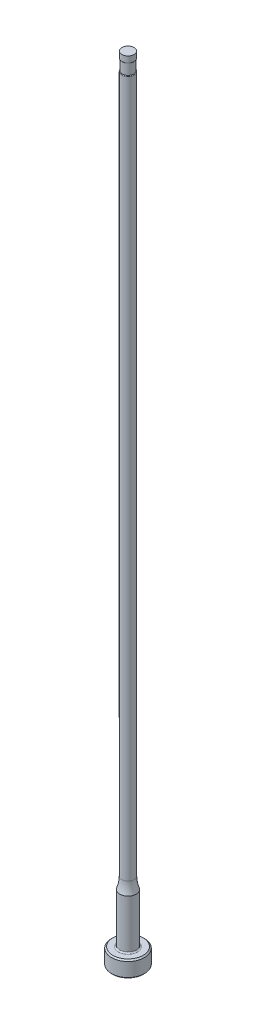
ISO-10303-21;
HEADER;
FILE_DESCRIPTION(('STEP AP214'),'2;1');
FILE_NAME('part.step','',(''),(''),'','','');
FILE_SCHEMA(('AUTOMOTIVE_DESIGN { 1 0 10303 214 1 1 1 1 }'));
ENDSEC;
DATA;
#1=APPLICATION_CONTEXT('core data for automotive mechanical design processes');
#2=APPLICATION_PROTOCOL_DEFINITION('international standard','automotive_design',2000,#1);
#3=PRODUCT_CONTEXT('',#1,'mechanical');
#4=PRODUCT('Part','Part','',(#3));
#5=PRODUCT_RELATED_PRODUCT_CATEGORY('part','',(#4));
#6=PRODUCT_DEFINITION_FORMATION('','',#4);
#7=PRODUCT_DEFINITION_CONTEXT('part definition',#1,'design');
#8=PRODUCT_DEFINITION('design','',#6,#7);
#9=PRODUCT_DEFINITION_SHAPE('','',#8);
#10=(LENGTH_UNIT() NAMED_UNIT(*) SI_UNIT(.MILLI.,.METRE.));
#11=(NAMED_UNIT(*) PLANE_ANGLE_UNIT() SI_UNIT($,.RADIAN.));
#12=(NAMED_UNIT(*) SI_UNIT($,.STERADIAN.) SOLID_ANGLE_UNIT());
#13=UNCERTAINTY_MEASURE_WITH_UNIT(LENGTH_MEASURE(1.E-05),#10,'distance_accuracy_value','');
#14=(GEOMETRIC_REPRESENTATION_CONTEXT(3) GLOBAL_UNCERTAINTY_ASSIGNED_CONTEXT((#13)) GLOBAL_UNIT_ASSIGNED_CONTEXT((#10,
#11,#12)) REPRESENTATION_CONTEXT('',''));
#15=CARTESIAN_POINT('',(0.,0.,0.));
#16=DIRECTION('',(0.,0.,1.));
#17=DIRECTION('',(1.,0.,0.));
#18=AXIS2_PLACEMENT_3D('',#15,#16,#17);
#19=CARTESIAN_POINT('',(0.,259.958771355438,0.));
#20=DIRECTION('',(0.,1.,0.));
#21=DIRECTION('',(0.,0.,1.));
#22=AXIS2_PLACEMENT_3D('',#19,#20,#21);
#23=CYLINDRICAL_SURFACE('',#22,1.18998999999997);
#24=DIRECTION('',(0.,1.,0.));
#25=VECTOR('',#24,1.);
#26=CARTESIAN_POINT('',(-1.08838999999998,259.958771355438,-0.481127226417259));
#27=LINE('',#26,#25);
#28=CARTESIAN_POINT('',(-1.08838999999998,148.973565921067,-0.481127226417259));
#29=VERTEX_POINT('',#28);
#30=CARTESIAN_POINT('',(-1.08838999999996,112.014,-0.481127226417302));
#31=VERTEX_POINT('',#30);
#32=EDGE_CURVE('E66',#29,#31,#27,.F.);
#33=ORIENTED_EDGE('',*,*,#32,.F.);
#34=CARTESIAN_POINT('',(0.,148.973565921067,0.));
#35=DIRECTION('',(0.,1.,0.));
#36=DIRECTION('',(0.,0.,1.));
#37=AXIS2_PLACEMENT_3D('',#34,#35,#36);
#38=CIRCLE('',#37,1.18998999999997);
#39=CARTESIAN_POINT('',(-1.08838999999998,148.973565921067,0.481127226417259));
#40=VERTEX_POINT('',#39);
#41=EDGE_CURVE('E44',#29,#40,#38,.F.);
#42=ORIENTED_EDGE('',*,*,#41,.T.);
#43=DIRECTION('',(0.,1.,0.));
#44=VECTOR('',#43,1.);
#45=CARTESIAN_POINT('',(-1.08838999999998,259.958771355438,0.481127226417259));
#46=LINE('',#45,#44);
#47=CARTESIAN_POINT('',(-1.08838999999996,112.014,0.481127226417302));
#48=VERTEX_POINT('',#47);
#49=EDGE_CURVE('E72',#48,#40,#46,.T.);
#50=ORIENTED_EDGE('',*,*,#49,.F.);
#51=CARTESIAN_POINT('',(-1.08838999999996,112.014,-0.481127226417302));
#52=CARTESIAN_POINT('',(-1.08838966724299,111.985183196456,-0.481120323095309));
#53=CARTESIAN_POINT('',(-1.08878297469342,111.956379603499,-0.480240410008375));
#54=CARTESIAN_POINT('',(-1.0903471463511,111.89887486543,-0.476680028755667));
#55=CARTESIAN_POINT('',(-1.09151883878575,111.870173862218,-0.473997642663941));
#56=CARTESIAN_POINT('',(-1.0962236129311,111.783732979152,-0.463079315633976));
#57=CARTESIAN_POINT('',(-1.10094613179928,111.726365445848,-0.451969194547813));
#58=CARTESIAN_POINT('',(-1.11171709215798,111.627397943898,-0.424640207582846));
#59=CARTESIAN_POINT('',(-1.11720060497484,111.585237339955,-0.41021369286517));
#60=CARTESIAN_POINT('',(-1.12939077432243,111.50375729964,-0.375363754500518));
#61=CARTESIAN_POINT('',(-1.13609165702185,111.46442562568,-0.354968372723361));
#62=CARTESIAN_POINT('',(-1.1472645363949,111.404969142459,-0.316366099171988));
#63=CARTESIAN_POINT('',(-1.15158336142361,111.383348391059,-0.300422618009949));
#64=CARTESIAN_POINT('',(-1.16012072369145,111.342602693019,-0.265553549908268));
#65=CARTESIAN_POINT('',(-1.16433935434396,111.323475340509,-0.246630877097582));
#66=CARTESIAN_POINT('',(-1.17139417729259,111.292625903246,-0.210179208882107));
#67=CARTESIAN_POINT('',(-1.17432972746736,111.280201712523,-0.193268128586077));
#68=CARTESIAN_POINT('',(-1.17964378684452,111.258180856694,-0.157607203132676));
#69=CARTESIAN_POINT('',(-1.18202305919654,111.248580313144,-0.138859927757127));
#70=CARTESIAN_POINT('',(-1.1856222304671,111.234246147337,-0.103155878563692));
#71=CARTESIAN_POINT('',(-1.1869702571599,111.228963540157,-0.0864338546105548));
#72=CARTESIAN_POINT('',(-1.18896221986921,111.221197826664,-0.05230931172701));
#73=CARTESIAN_POINT('',(-1.18960661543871,111.218712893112,-0.0349072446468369));
#74=CARTESIAN_POINT('',(-1.1901191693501,111.216734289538,0.000122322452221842));
#75=CARTESIAN_POINT('',(-1.18998545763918,111.217247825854,0.0177502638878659));
#76=CARTESIAN_POINT('',(-1.18895328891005,111.221240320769,0.0526432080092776));
#77=CARTESIAN_POINT('',(-1.18805460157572,111.224720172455,0.0699080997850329));
#78=CARTESIAN_POINT('',(-1.18562828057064,111.23423683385,0.103108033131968));
#79=CARTESIAN_POINT('',(-1.18411982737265,111.240195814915,0.11906720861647));
#80=CARTESIAN_POINT('',(-1.18061056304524,111.254296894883,0.149921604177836));
#81=CARTESIAN_POINT('',(-1.17860955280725,111.262439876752,0.164816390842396));
#82=CARTESIAN_POINT('',(-1.17313921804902,111.285184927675,0.200749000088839));
#83=CARTESIAN_POINT('',(-1.1694436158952,111.300956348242,0.221012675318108));
#84=CARTESIAN_POINT('',(-1.16168543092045,111.335494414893,0.258718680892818));
#85=CARTESIAN_POINT('',(-1.15762196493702,111.354268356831,0.276153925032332));
#86=CARTESIAN_POINT('',(-1.14734460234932,111.404227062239,0.316729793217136));
#87=CARTESIAN_POINT('',(-1.14110751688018,111.436801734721,0.338145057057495));
#88=CARTESIAN_POINT('',(-1.12927494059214,111.504924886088,0.375765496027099));
#89=CARTESIAN_POINT('',(-1.12368108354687,111.54048055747,0.391957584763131));
#90=CARTESIAN_POINT('',(-1.11078204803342,111.633330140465,0.427525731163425));
#91=CARTESIAN_POINT('',(-1.10420802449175,111.691901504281,0.443819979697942));
#92=CARTESIAN_POINT('',(-1.09432365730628,111.810957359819,0.467642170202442));
#93=CARTESIAN_POINT('',(-1.09101219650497,111.871441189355,0.475173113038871));
#94=CARTESIAN_POINT('',(-1.0890934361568,111.945778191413,0.479532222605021));
#95=CARTESIAN_POINT('',(-1.08882945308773,111.959431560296,0.480131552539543));
#96=CARTESIAN_POINT('',(-1.08847803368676,111.986722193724,0.480928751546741));
#97=CARTESIAN_POINT('',(-1.08839020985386,112.000359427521,0.481127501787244));
#98=CARTESIAN_POINT('',(-1.08838999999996,112.014,0.481127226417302));
#99=B_SPLINE_CURVE_WITH_KNOTS('',3,(#51,#52,#53,#54,#55,#56,#57,#58,#59,#60,#61,#62,#63,#64,#65,
#66,#67,#68,#69,#70,#71,#72,#73,#74,#75,#76,#77,#78,#79,#80,#81,#82,#83,#84,#85,#86,#87,#88,#89,
#90,#91,#92,#93,#94,#95,#96,#97,#98),.UNSPECIFIED.,.F.,.F.,(4,2,2,2,2,2,2,2,2,2,2,2,2,2,2,2,2,2,
2,2,2,2,2,4),(0.,0.0864065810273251,0.172905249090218,0.348016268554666,0.48234589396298,
0.616054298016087,0.697472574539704,0.778811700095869,0.842154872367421,0.905410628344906,
0.95794971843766,1.01045447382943,1.0630854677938,1.11573231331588,1.16683808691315,
1.21796455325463,1.29535063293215,1.37292769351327,1.49070506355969,1.60877526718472,
1.79125586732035,1.9736739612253,2.01467753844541,2.05559081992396),.UNSPECIFIED.);
#100=EDGE_CURVE('E74',#31,#48,#99,.T.);
#101=ORIENTED_EDGE('',*,*,#100,.F.);
#102=EDGE_LOOP('',(#33,#42,#50,#101));
#103=FACE_BOUND('',#102,.T.);
#104=CARTESIAN_POINT('',(0.,14.9114164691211,0.));
#105=DIRECTION('',(0.,1.,0.));
#106=DIRECTION('',(0.,0.,1.));
#107=AXIS2_PLACEMENT_3D('',#104,#105,#106);
#108=CIRCLE('',#107,1.18998999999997);
#109=CARTESIAN_POINT('',(0.,14.9114164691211,1.18998999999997));
#110=VERTEX_POINT('',#109);
#111=EDGE_CURVE('E95',#110,#110,#108,.T.);
#112=ORIENTED_EDGE('',*,*,#111,.T.);
#113=EDGE_LOOP('',(#112));
#114=FACE_BOUND('',#113,.T.);
#115=ADVANCED_FACE('F36',(#103,#114),#23,.T.);
#116=CARTESIAN_POINT('',(0.,14.9114164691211,0.));
#117=DIRECTION('',(0.,1.,0.));
#118=DIRECTION('',(0.,0.,1.));
#119=AXIS2_PLACEMENT_3D('',#116,#117,#118);
#120=TOROIDAL_SURFACE('',#119,7.53998999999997,6.35);
#121=CARTESIAN_POINT('',(0.,12.7,0.));
#122=DIRECTION('',(0.,1.,0.));
#123=DIRECTION('',(0.,0.,1.));
#124=AXIS2_PLACEMENT_3D('',#121,#122,#123);
#125=CIRCLE('',#124,1.58749999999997);
#126=CARTESIAN_POINT('',(0.,12.7,1.58749999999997));
#127=VERTEX_POINT('',#126);
#128=EDGE_CURVE('E92',#127,#127,#125,.T.);
#129=ORIENTED_EDGE('',*,*,#128,.T.);
#130=EDGE_LOOP('',(#129));
#131=FACE_BOUND('',#130,.T.);
#132=ORIENTED_EDGE('',*,*,#111,.F.);
#133=EDGE_LOOP('',(#132));
#134=FACE_BOUND('',#133,.T.);
#135=ADVANCED_FACE('F156',(#131,#134),#120,.F.);
#136=CARTESIAN_POINT('',(0.,259.958771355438,0.));
#137=DIRECTION('',(0.,1.,0.));
#138=DIRECTION('',(0.,0.,1.));
#139=AXIS2_PLACEMENT_3D('',#136,#137,#138);
#140=CYLINDRICAL_SURFACE('',#139,1.58749999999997);
#141=CARTESIAN_POINT('',(0.,3.42900000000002,0.));
#142=DIRECTION('',(0.,1.,0.));
#143=DIRECTION('',(0.,0.,1.));
#144=AXIS2_PLACEMENT_3D('',#141,#142,#143);
#145=CIRCLE('',#144,1.58749999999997);
#146=CARTESIAN_POINT('',(0.,3.42900000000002,1.58749999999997));
#147=VERTEX_POINT('',#146);
#148=EDGE_CURVE('E110',#147,#147,#145,.T.);
#149=ORIENTED_EDGE('',*,*,#148,.T.);
#150=EDGE_LOOP('',(#149));
#151=FACE_BOUND('',#150,.T.);
#152=ORIENTED_EDGE('',*,*,#128,.F.);
#153=EDGE_LOOP('',(#152));
#154=FACE_BOUND('',#153,.T.);
#155=ADVANCED_FACE('F153',(#151,#154),#140,.T.);
#156=CARTESIAN_POINT('',(-3.17499999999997,3.175,0.));
#157=DIRECTION('',(0.,1.,0.));
#158=DIRECTION('',(0.,0.,1.));
#159=AXIS2_PLACEMENT_3D('',#156,#157,#158);
#160=PLANE('',#159);
#161=CARTESIAN_POINT('',(0.,3.175,0.));
#162=DIRECTION('',(0.,1.,0.));
#163=DIRECTION('',(0.,0.,1.));
#164=AXIS2_PLACEMENT_3D('',#161,#162,#163);
#165=CIRCLE('',#164,1.84149999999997);
#166=CARTESIAN_POINT('',(0.,3.175,1.84149999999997));
#167=VERTEX_POINT('',#166);
#168=EDGE_CURVE('E78',#167,#167,#165,.F.);
#169=ORIENTED_EDGE('',*,*,#168,.T.);
#170=EDGE_LOOP('',(#169));
#171=FACE_BOUND('',#170,.T.);
#172=CARTESIAN_POINT('',(0.,3.175,0.));
#173=DIRECTION('',(0.,1.,0.));
#174=DIRECTION('',(0.,0.,1.));
#175=AXIS2_PLACEMENT_3D('',#172,#173,#174);
#176=CIRCLE('',#175,2.92099999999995);
#177=CARTESIAN_POINT('',(0.,3.175,2.92099999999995));
#178=VERTEX_POINT('',#177);
#179=EDGE_CURVE('E98',#178,#178,#176,.T.);
#180=ORIENTED_EDGE('',*,*,#179,.T.);
#181=EDGE_LOOP('',(#180));
#182=FACE_BOUND('',#181,.T.);
#183=ADVANCED_FACE('F149',(#171,#182),#160,.T.);
#184=CARTESIAN_POINT('',(0.,259.958771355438,0.));
#185=DIRECTION('',(0.,1.,0.));
#186=DIRECTION('',(0.,0.,1.));
#187=AXIS2_PLACEMENT_3D('',#184,#185,#186);
#188=CYLINDRICAL_SURFACE('',#187,3.17499999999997);
#189=CARTESIAN_POINT('',(0.,2.92100000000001,0.));
#190=DIRECTION('',(0.,1.,0.));
#191=DIRECTION('',(0.,0.,1.));
#192=AXIS2_PLACEMENT_3D('',#189,#190,#191);
#193=CIRCLE('',#192,3.17499999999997);
#194=CARTESIAN_POINT('',(0.,2.92100000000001,3.17499999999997));
#195=VERTEX_POINT('',#194);
#196=EDGE_CURVE('E104',#195,#195,#193,.F.);
#197=ORIENTED_EDGE('',*,*,#196,.T.);
#198=EDGE_LOOP('',(#197));
#199=FACE_BOUND('',#198,.T.);
#200=CARTESIAN_POINT('',(0.,0.254000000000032,0.));
#201=DIRECTION('',(0.,-1.,0.));
#202=DIRECTION('',(0.,0.,-1.));
#203=AXIS2_PLACEMENT_3D('',#200,#201,#202);
#204=CIRCLE('',#203,3.17499999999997);
#205=CARTESIAN_POINT('',(0.,0.254000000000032,-3.17499999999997));
#206=VERTEX_POINT('',#205);
#207=EDGE_CURVE('E101',#206,#206,#204,.F.);
#208=ORIENTED_EDGE('',*,*,#207,.T.);
#209=EDGE_LOOP('',(#208));
#210=FACE_BOUND('',#209,.T.);
#211=ADVANCED_FACE('F145',(#199,#210),#188,.T.);
#212=CARTESIAN_POINT('',(0.,0.,0.));
#213=DIRECTION('',(0.,-1.,0.));
#214=DIRECTION('',(0.,0.,-1.));
#215=AXIS2_PLACEMENT_3D('',#212,#213,#214);
#216=PLANE('',#215);
#217=CARTESIAN_POINT('',(0.,0.,0.));
#218=DIRECTION('',(0.,-1.,0.));
#219=DIRECTION('',(0.,0.,-1.));
#220=AXIS2_PLACEMENT_3D('',#217,#218,#219);
#221=CIRCLE('',#220,2.92099999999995);
#222=CARTESIAN_POINT('',(0.,0.,-2.92099999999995));
#223=VERTEX_POINT('',#222);
#224=EDGE_CURVE('E107',#223,#223,#221,.T.);
#225=ORIENTED_EDGE('',*,*,#224,.T.);
#226=EDGE_LOOP('',(#225));
#227=FACE_BOUND('',#226,.T.);
#228=ADVANCED_FACE('F141',(#227),#216,.T.);
#229=CARTESIAN_POINT('',(0.,3.17499999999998,0.));
#230=DIRECTION('',(0.,-1.,0.));
#231=DIRECTION('',(0.,0.,-1.));
#232=AXIS2_PLACEMENT_3D('',#229,#230,#231);
#233=CONICAL_SURFACE('',#232,2.92099999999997,0.7853981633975);
#234=ORIENTED_EDGE('',*,*,#196,.F.);
#235=EDGE_LOOP('',(#234));
#236=FACE_BOUND('',#235,.T.);
#237=ORIENTED_EDGE('',*,*,#179,.F.);
#238=EDGE_LOOP('',(#237));
#239=FACE_BOUND('',#238,.T.);
#240=ADVANCED_FACE('F144',(#236,#239),#233,.T.);
#241=CARTESIAN_POINT('',(0.,0.254000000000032,0.));
#242=DIRECTION('',(0.,1.,0.));
#243=DIRECTION('',(0.,0.,1.));
#244=AXIS2_PLACEMENT_3D('',#241,#242,#243);
#245=CONICAL_SURFACE('',#244,3.17499999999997,0.785398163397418);
#246=ORIENTED_EDGE('',*,*,#224,.F.);
#247=EDGE_LOOP('',(#246));
#248=FACE_BOUND('',#247,.T.);
#249=ORIENTED_EDGE('',*,*,#207,.F.);
#250=EDGE_LOOP('',(#249));
#251=FACE_BOUND('',#250,.T.);
#252=ADVANCED_FACE('F245',(#248,#251),#245,.T.);
#253=CARTESIAN_POINT('',(0.,3.42900000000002,0.));
#254=DIRECTION('',(0.,1.,0.));
#255=DIRECTION('',(0.,0.,1.));
#256=AXIS2_PLACEMENT_3D('',#253,#254,#255);
#257=TOROIDAL_SURFACE('',#256,1.84149999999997,0.254);
#258=ORIENTED_EDGE('',*,*,#168,.F.);
#259=EDGE_LOOP('',(#258));
#260=FACE_BOUND('',#259,.T.);
#261=ORIENTED_EDGE('',*,*,#148,.F.);
#262=EDGE_LOOP('',(#261));
#263=FACE_BOUND('',#262,.T.);
#264=ADVANCED_FACE('F139',(#260,#263),#257,.F.);
#265=CARTESIAN_POINT('',(0.,153.448281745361,0.));
#266=DIRECTION('',(0.,1.,0.));
#267=DIRECTION('',(0.,0.,1.));
#268=AXIS2_PLACEMENT_3D('',#265,#266,#267);
#269=CYLINDRICAL_SURFACE('',#268,1.08838999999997);
#270=CARTESIAN_POINT('',(0.,151.13,0.));
#271=DIRECTION('',(0.,1.,0.));
#272=DIRECTION('',(0.,0.,1.));
#273=AXIS2_PLACEMENT_3D('',#270,#271,#272);
#274=CIRCLE('',#273,1.08838999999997);
#275=CARTESIAN_POINT('',(0.,151.13,1.08838999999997));
#276=VERTEX_POINT('',#275);
#277=EDGE_CURVE('E71',#276,#276,#274,.T.);
#278=ORIENTED_EDGE('',*,*,#277,.F.);
#279=EDGE_LOOP('',(#278));
#280=FACE_BOUND('',#279,.T.);
#281=CARTESIAN_POINT('',(0.,149.098,0.));
#282=DIRECTION('',(0.,1.,0.));
#283=DIRECTION('',(0.,0.,1.));
#284=AXIS2_PLACEMENT_3D('',#281,#282,#283);
#285=CIRCLE('',#284,1.08838999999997);
#286=CARTESIAN_POINT('',(-1.08838999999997,149.098,0.));
#287=VERTEX_POINT('',#286);
#288=EDGE_CURVE('E89',#287,#287,#285,.T.);
#289=ORIENTED_EDGE('',*,*,#288,.T.);
#290=EDGE_LOOP('',(#289));
#291=FACE_BOUND('',#290,.T.);
#292=ADVANCED_FACE('F136',(#280,#291),#269,.T.);
#293=CARTESIAN_POINT('',(-1.08838999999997,150.114,-3.17499999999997));
#294=DIRECTION('',(1.,0.,0.));
#295=DIRECTION('',(0.,1.,0.));
#296=AXIS2_PLACEMENT_3D('',#293,#294,#295);
#297=PLANE('',#296);
#298=CARTESIAN_POINT('',(-1.08838999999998,148.973565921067,0.481127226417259));
#299=CARTESIAN_POINT('',(-1.08838999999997,148.976730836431,0.481135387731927));
#300=CARTESIAN_POINT('',(-1.08838999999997,148.979885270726,0.480835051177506));
#301=CARTESIAN_POINT('',(-1.08838999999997,148.98605903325,0.479692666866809));
#302=CARTESIAN_POINT('',(-1.08838999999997,148.989079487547,0.478856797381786));
#303=CARTESIAN_POINT('',(-1.08838999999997,148.995599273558,0.476477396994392));
#304=CARTESIAN_POINT('',(-1.08838999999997,148.999055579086,0.474817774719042));
#305=CARTESIAN_POINT('',(-1.08838999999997,149.00566384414,0.470958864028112));
#306=CARTESIAN_POINT('',(-1.08838999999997,149.008814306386,0.468757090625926));
#307=CARTESIAN_POINT('',(-1.08838999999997,149.016477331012,0.462614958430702));
#308=CARTESIAN_POINT('',(-1.08838999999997,149.020761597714,0.458392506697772));
#309=CARTESIAN_POINT('',(-1.08838999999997,149.028655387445,0.449369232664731));
#310=CARTESIAN_POINT('',(-1.08838999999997,149.032263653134,0.444567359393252));
#311=CARTESIAN_POINT('',(-1.08838999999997,149.042137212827,0.429819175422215));
#312=CARTESIAN_POINT('',(-1.08838999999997,149.047627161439,0.419360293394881));
#313=CARTESIAN_POINT('',(-1.08838999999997,149.057180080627,0.397821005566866));
#314=CARTESIAN_POINT('',(-1.08838999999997,149.061238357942,0.386738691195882));
#315=CARTESIAN_POINT('',(-1.08838999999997,149.072260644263,0.35189969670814));
#316=CARTESIAN_POINT('',(-1.08838999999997,149.077509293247,0.327613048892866));
#317=CARTESIAN_POINT('',(-1.08838999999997,149.085621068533,0.278627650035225));
#318=CARTESIAN_POINT('',(-1.08838999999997,149.088474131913,0.253927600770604));
#319=CARTESIAN_POINT('',(-1.08838999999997,149.092780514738,0.204271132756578));
#320=CARTESIAN_POINT('',(-1.08838999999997,149.09422603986,0.179314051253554));
#321=CARTESIAN_POINT('',(-1.08838999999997,149.096315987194,0.129366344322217));
#322=CARTESIAN_POINT('',(-1.08838999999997,149.096960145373,0.10437571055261));
#323=CARTESIAN_POINT('',(-1.08838999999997,149.097594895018,0.0661077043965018));
#324=CARTESIAN_POINT('',(-1.08838999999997,149.097750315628,0.0528328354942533));
#325=CARTESIAN_POINT('',(-1.08838999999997,149.097951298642,0.0263719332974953));
#326=CARTESIAN_POINT('',(-1.08838999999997,149.097997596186,0.0131859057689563));
#327=CARTESIAN_POINT('',(-1.08838999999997,149.098,0.));
#328=B_SPLINE_CURVE_WITH_KNOTS('',3,(#298,#299,#300,#301,#302,#303,#304,#305,#306,#307,#308,
#309,#310,#311,#312,#313,#314,#315,#316,#317,#318,#319,#320,#321,#322,#323,#324,#325,#326,#327),
.UNSPECIFIED.,.F.,.F.,(4,2,2,2,2,2,2,2,2,2,2,2,2,2,4),(0.,0.0094635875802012,0.0188199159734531,
0.0302585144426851,0.0417505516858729,0.0596944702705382,0.0776714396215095,0.11290930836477,
0.148261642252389,0.222508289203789,0.297065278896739,0.372032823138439,0.4470250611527,
0.486851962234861,0.526409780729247),.UNSPECIFIED.);
#329=EDGE_CURVE('E77',#40,#287,#328,.T.);
#330=ORIENTED_EDGE('',*,*,#329,.T.);
#331=CARTESIAN_POINT('',(-1.08838999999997,149.098,0.));
#332=CARTESIAN_POINT('',(-1.08838999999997,149.097979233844,-0.0211714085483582));
#333=CARTESIAN_POINT('',(-1.08838999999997,149.097872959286,-0.0423450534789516));
#334=CARTESIAN_POINT('',(-1.08838999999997,149.097341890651,-0.0847174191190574));
#335=CARTESIAN_POINT('',(-1.08838999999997,149.096916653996,-0.105916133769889));
#336=CARTESIAN_POINT('',(-1.08838999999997,149.095599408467,-0.148299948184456));
#337=CARTESIAN_POINT('',(-1.08838999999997,149.094707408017,-0.169485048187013));
#338=CARTESIAN_POINT('',(-1.08838999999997,149.092153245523,-0.211801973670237));
#339=CARTESIAN_POINT('',(-1.08838999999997,149.090491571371,-0.23293382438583));
#340=CARTESIAN_POINT('',(-1.08838999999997,149.0867838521,-0.267143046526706));
#341=CARTESIAN_POINT('',(-1.08838999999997,149.085117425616,-0.280260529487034));
#342=CARTESIAN_POINT('',(-1.08838999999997,149.081125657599,-0.306428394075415));
#343=CARTESIAN_POINT('',(-1.08838999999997,149.078798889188,-0.319478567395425));
#344=CARTESIAN_POINT('',(-1.08838999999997,149.072882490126,-0.347140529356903));
#345=CARTESIAN_POINT('',(-1.08838999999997,149.069164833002,-0.361725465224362));
#346=CARTESIAN_POINT('',(-1.08838999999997,149.060079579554,-0.390359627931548));
#347=CARTESIAN_POINT('',(-1.08838999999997,149.054719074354,-0.404410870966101));
#348=CARTESIAN_POINT('',(-1.08838999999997,149.045612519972,-0.422803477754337));
#349=CARTESIAN_POINT('',(-1.08838999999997,149.04297440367,-0.42768908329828));
#350=CARTESIAN_POINT('',(-1.08838999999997,149.037260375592,-0.437212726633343));
#351=CARTESIAN_POINT('',(-1.08838999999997,149.034183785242,-0.441850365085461));
#352=CARTESIAN_POINT('',(-1.08838999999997,149.027476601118,-0.45078486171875));
#353=CARTESIAN_POINT('',(-1.08838999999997,149.023840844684,-0.455077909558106));
#354=CARTESIAN_POINT('',(-1.08838999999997,149.015937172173,-0.463042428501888));
#355=CARTESIAN_POINT('',(-1.08838999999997,149.011671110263,-0.466715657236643));
#356=CARTESIAN_POINT('',(-1.08838999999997,149.004303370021,-0.47179758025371));
#357=CARTESIAN_POINT('',(-1.08838999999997,149.001421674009,-0.473523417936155));
#358=CARTESIAN_POINT('',(-1.08838999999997,148.995432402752,-0.476511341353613));
#359=CARTESIAN_POINT('',(-1.08838999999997,148.992325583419,-0.47777490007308));
#360=CARTESIAN_POINT('',(-1.08838999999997,148.986621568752,-0.479523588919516));
#361=CARTESIAN_POINT('',(-1.08838999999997,148.984057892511,-0.480117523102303));
#362=CARTESIAN_POINT('',(-1.08838999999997,148.978853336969,-0.480922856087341));
#363=CARTESIAN_POINT('',(-1.08838999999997,148.976212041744,-0.481131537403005));
#364=CARTESIAN_POINT('',(-1.08838999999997,148.973565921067,-0.481127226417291));
#365=B_SPLINE_CURVE_WITH_KNOTS('',3,(#331,#332,#333,#334,#335,#336,#337,#338,#339,#340,#341,
#342,#343,#344,#345,#346,#347,#348,#349,#350,#351,#352,#353,#354,#355,#356,#357,#358,#359,#360,
#361,#362,#363,#364),.UNSPECIFIED.,.F.,.F.,(4,2,2,2,2,2,2,2,2,2,2,2,2,2,2,2,4),(0.,
0.0635177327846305,0.127123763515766,0.190728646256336,0.254293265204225,0.293950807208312,
0.333694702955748,0.37880060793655,0.423714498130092,0.440354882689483,0.457021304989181,
0.473852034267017,0.490634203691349,0.500679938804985,0.510693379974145,0.518560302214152,
0.526482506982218),.UNSPECIFIED.);
#366=EDGE_CURVE('E58',#287,#29,#365,.T.);
#367=ORIENTED_EDGE('',*,*,#366,.T.);
#368=ORIENTED_EDGE('',*,*,#32,.T.);
#369=DIRECTION('',(0.,0.,1.));
#370=VECTOR('',#369,1.);
#371=CARTESIAN_POINT('',(-1.08838999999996,112.014,-3.17499999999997));
#372=LINE('',#371,#370);
#373=EDGE_CURVE('E70',#31,#48,#372,.T.);
#374=ORIENTED_EDGE('',*,*,#373,.T.);
#375=ORIENTED_EDGE('',*,*,#49,.T.);
#376=EDGE_LOOP('',(#330,#367,#368,#374,#375));
#377=FACE_BOUND('',#376,.T.);
#378=ADVANCED_FACE('F68',(#377),#297,.F.);
#379=CARTESIAN_POINT('',(-4.26338999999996,112.014,-3.17499999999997));
#380=DIRECTION('',(0.,0.,1.));
#381=DIRECTION('',(1.,0.,0.));
#382=AXIS2_PLACEMENT_3D('',#379,#380,#381);
#383=CYLINDRICAL_SURFACE('',#382,3.175);
#384=ORIENTED_EDGE('',*,*,#373,.F.);
#385=ORIENTED_EDGE('',*,*,#100,.T.);
#386=EDGE_LOOP('',(#384,#385));
#387=FACE_BOUND('',#386,.T.);
#388=ADVANCED_FACE('F80',(#387),#383,.F.);
#389=CARTESIAN_POINT('',(0.,152.687735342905,0.));
#390=DIRECTION('',(0.,1.,0.));
#391=DIRECTION('',(0.,0.,1.));
#392=AXIS2_PLACEMENT_3D('',#389,#390,#391);
#393=CYLINDRICAL_SURFACE('',#392,1.17093999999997);
#394=CARTESIAN_POINT('',(0.,151.24896721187,0.));
#395=DIRECTION('',(0.,-1.,0.));
#396=DIRECTION('',(0.,0.,-1.));
#397=AXIS2_PLACEMENT_3D('',#394,#395,#396);
#398=CIRCLE('',#397,1.17093999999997);
#399=CARTESIAN_POINT('',(0.,151.24896721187,-1.17093999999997));
#400=VERTEX_POINT('',#399);
#401=EDGE_CURVE('E11',#400,#400,#398,.F.);
#402=ORIENTED_EDGE('',*,*,#401,.T.);
#403=EDGE_LOOP('',(#402));
#404=FACE_BOUND('',#403,.T.);
#405=CARTESIAN_POINT('',(0.,152.4,0.));
#406=DIRECTION('',(0.,1.,0.));
#407=DIRECTION('',(0.,0.,1.));
#408=AXIS2_PLACEMENT_3D('',#405,#406,#407);
#409=CIRCLE('',#408,1.17093999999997);
#410=CARTESIAN_POINT('',(0.,152.4,1.17093999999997));
#411=VERTEX_POINT('',#410);
#412=EDGE_CURVE('E81',#411,#411,#409,.T.);
#413=ORIENTED_EDGE('',*,*,#412,.F.);
#414=EDGE_LOOP('',(#413));
#415=FACE_BOUND('',#414,.T.);
#416=ADVANCED_FACE('F133',(#404,#415),#393,.T.);
#417=CARTESIAN_POINT('',(-1.18998999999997,152.4,0.));
#418=DIRECTION('',(0.,1.,0.));
#419=DIRECTION('',(0.,0.,1.));
#420=AXIS2_PLACEMENT_3D('',#417,#418,#419);
#421=PLANE('',#420);
#422=ORIENTED_EDGE('',*,*,#412,.T.);
#423=EDGE_LOOP('',(#422));
#424=FACE_BOUND('',#423,.T.);
#425=ADVANCED_FACE('F177',(#424),#421,.T.);
#426=CARTESIAN_POINT('',(0.,148.973565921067,0.));
#427=DIRECTION('',(0.,1.,0.));
#428=DIRECTION('',(0.,0.,1.));
#429=AXIS2_PLACEMENT_3D('',#426,#427,#428);
#430=TOROIDAL_SURFACE('',#429,1.06298999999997,0.127);
#431=ORIENTED_EDGE('',*,*,#329,.F.);
#432=ORIENTED_EDGE('',*,*,#41,.F.);
#433=ORIENTED_EDGE('',*,*,#366,.F.);
#434=ORIENTED_EDGE('',*,*,#288,.F.);
#435=EDGE_LOOP('',(#431,#432,#433,#434));
#436=FACE_BOUND('',#435,.T.);
#437=ADVANCED_FACE('F209',(#436),#430,.T.);
#438=CARTESIAN_POINT('',(0.,151.24896721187,0.));
#439=DIRECTION('',(0.,-1.,0.));
#440=DIRECTION('',(0.,0.,-1.));
#441=AXIS2_PLACEMENT_3D('',#438,#439,#440);
#442=TOROIDAL_SURFACE('',#441,1.04393999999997,0.127);
#443=ORIENTED_EDGE('',*,*,#277,.T.);
#444=EDGE_LOOP('',(#443));
#445=FACE_BOUND('',#444,.T.);
#446=ORIENTED_EDGE('',*,*,#401,.F.);
#447=EDGE_LOOP('',(#446));
#448=FACE_BOUND('',#447,.T.);
#449=ADVANCED_FACE('F38',(#445,#448),#442,.T.);
#450=CLOSED_SHELL('',(#115,#135,#155,#183,#211,#228,#240,#252,#264,#292,#378,#388,#416,#425,
#437,#449));
#451=MANIFOLD_SOLID_BREP('B2',#450);
#452=ADVANCED_BREP_SHAPE_REPRESENTATION('',(#18,#451),#14);
#453=SHAPE_DEFINITION_REPRESENTATION(#9,#452);
ENDSEC;
END-ISO-10303-21;
